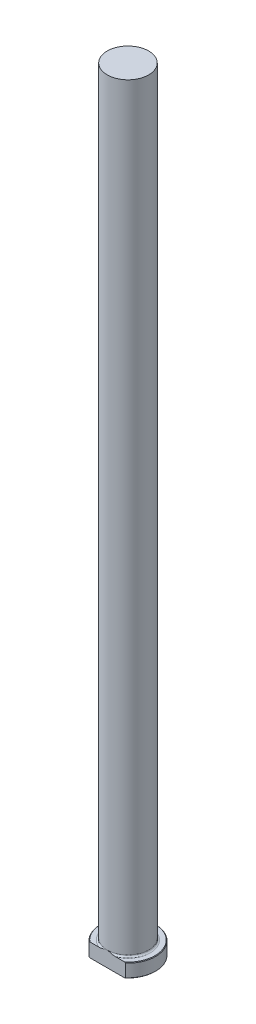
ISO-10303-21;
HEADER;
FILE_DESCRIPTION(('STEP AP214'),'2;1');
FILE_NAME('part.step','',(''),(''),'','','');
FILE_SCHEMA(('AUTOMOTIVE_DESIGN { 1 0 10303 214 1 1 1 1 }'));
ENDSEC;
DATA;
#1=APPLICATION_CONTEXT('core data for automotive mechanical design processes');
#2=APPLICATION_PROTOCOL_DEFINITION('international standard','automotive_design',2000,#1);
#3=PRODUCT_CONTEXT('',#1,'mechanical');
#4=PRODUCT('Part','Part','',(#3));
#5=PRODUCT_RELATED_PRODUCT_CATEGORY('part','',(#4));
#6=PRODUCT_DEFINITION_FORMATION('','',#4);
#7=PRODUCT_DEFINITION_CONTEXT('part definition',#1,'design');
#8=PRODUCT_DEFINITION('design','',#6,#7);
#9=PRODUCT_DEFINITION_SHAPE('','',#8);
#10=(LENGTH_UNIT() NAMED_UNIT(*) SI_UNIT(.MILLI.,.METRE.));
#11=(NAMED_UNIT(*) PLANE_ANGLE_UNIT() SI_UNIT($,.RADIAN.));
#12=(NAMED_UNIT(*) SI_UNIT($,.STERADIAN.) SOLID_ANGLE_UNIT());
#13=UNCERTAINTY_MEASURE_WITH_UNIT(LENGTH_MEASURE(1.E-05),#10,'distance_accuracy_value','');
#14=(GEOMETRIC_REPRESENTATION_CONTEXT(3) GLOBAL_UNCERTAINTY_ASSIGNED_CONTEXT((#13)) GLOBAL_UNIT_ASSIGNED_CONTEXT((#10,
#11,#12)) REPRESENTATION_CONTEXT('',''));
#15=CARTESIAN_POINT('',(0.,0.,0.));
#16=DIRECTION('',(0.,0.,1.));
#17=DIRECTION('',(1.,0.,0.));
#18=AXIS2_PLACEMENT_3D('',#15,#16,#17);
#19=CARTESIAN_POINT('',(0.,0.,0.));
#20=DIRECTION('',(0.,-1.,0.));
#21=DIRECTION('',(0.,0.,-1.));
#22=AXIS2_PLACEMENT_3D('',#19,#20,#21);
#23=PLANE('',#22);
#24=DIRECTION('',(1.,0.,0.));
#25=VECTOR('',#24,1.);
#26=CARTESIAN_POINT('',(-8.40026041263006,0.,9.52499999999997));
#27=LINE('',#26,#25);
#28=CARTESIAN_POINT('',(-8.01107302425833,0.,9.52499999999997));
#29=VERTEX_POINT('',#28);
#30=CARTESIAN_POINT('',(8.01107302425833,0.,9.52499999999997));
#31=VERTEX_POINT('',#30);
#32=EDGE_CURVE('E92',#29,#31,#27,.T.);
#33=ORIENTED_EDGE('',*,*,#32,.F.);
#34=CARTESIAN_POINT('',(0.,0.,0.));
#35=DIRECTION('',(0.,-1.,0.));
#36=DIRECTION('',(0.,0.,-1.));
#37=AXIS2_PLACEMENT_3D('',#34,#35,#36);
#38=CIRCLE('',#37,12.446);
#39=EDGE_CURVE('E105',#29,#31,#38,.T.);
#40=ORIENTED_EDGE('',*,*,#39,.T.);
#41=EDGE_LOOP('',(#33,#40));
#42=FACE_BOUND('',#41,.T.);
#43=ADVANCED_FACE('F37',(#42),#23,.T.);
#44=CARTESIAN_POINT('',(0.,259.958771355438,0.));
#45=DIRECTION('',(0.,1.,0.));
#46=DIRECTION('',(0.,0.,1.));
#47=AXIS2_PLACEMENT_3D('',#44,#45,#46);
#48=CYLINDRICAL_SURFACE('',#47,12.7);
#49=DIRECTION('',(0.,-1.,0.));
#50=VECTOR('',#49,1.);
#51=CARTESIAN_POINT('',(-8.40026041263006,355.6,9.52499999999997));
#52=LINE('',#51,#50);
#53=CARTESIAN_POINT('',(-8.40026041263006,6.0960000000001,9.52499999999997));
#54=VERTEX_POINT('',#53);
#55=CARTESIAN_POINT('',(-8.40026041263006,0.253999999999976,9.52499999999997));
#56=VERTEX_POINT('',#55);
#57=EDGE_CURVE('E95',#54,#56,#52,.T.);
#58=ORIENTED_EDGE('',*,*,#57,.F.);
#59=CARTESIAN_POINT('',(0.,6.0960000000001,0.));
#60=DIRECTION('',(0.,1.,0.));
#61=DIRECTION('',(0.,0.,1.));
#62=AXIS2_PLACEMENT_3D('',#59,#60,#61);
#63=CIRCLE('',#62,12.7);
#64=CARTESIAN_POINT('',(8.40026041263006,6.0960000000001,9.52499999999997));
#65=VERTEX_POINT('',#64);
#66=EDGE_CURVE('E109',#54,#65,#63,.F.);
#67=ORIENTED_EDGE('',*,*,#66,.T.);
#68=DIRECTION('',(0.,-1.,0.));
#69=VECTOR('',#68,1.);
#70=CARTESIAN_POINT('',(8.40026041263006,355.6,9.52499999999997));
#71=LINE('',#70,#69);
#72=CARTESIAN_POINT('',(8.40026041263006,0.253999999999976,9.52499999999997));
#73=VERTEX_POINT('',#72);
#74=EDGE_CURVE('E187',#65,#73,#71,.T.);
#75=ORIENTED_EDGE('',*,*,#74,.T.);
#76=CARTESIAN_POINT('',(0.,0.253999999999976,0.));
#77=DIRECTION('',(0.,-1.,0.));
#78=DIRECTION('',(0.,0.,-1.));
#79=AXIS2_PLACEMENT_3D('',#76,#77,#78);
#80=CIRCLE('',#79,12.7);
#81=EDGE_CURVE('E115',#73,#56,#80,.F.);
#82=ORIENTED_EDGE('',*,*,#81,.T.);
#83=EDGE_LOOP('',(#58,#67,#75,#82));
#84=FACE_BOUND('',#83,.T.);
#85=ADVANCED_FACE('F160',(#84),#48,.T.);
#86=CARTESIAN_POINT('',(-12.7,6.35,0.));
#87=DIRECTION('',(0.,1.,0.));
#88=DIRECTION('',(0.,0.,1.));
#89=AXIS2_PLACEMENT_3D('',#86,#87,#88);
#90=PLANE('',#89);
#91=DIRECTION('',(-1.,0.,0.));
#92=VECTOR('',#91,1.);
#93=CARTESIAN_POINT('',(-12.7,6.35,9.52499999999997));
#94=LINE('',#93,#92);
#95=CARTESIAN_POINT('',(8.01107302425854,6.35,9.52499999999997));
#96=VERTEX_POINT('',#95);
#97=CARTESIAN_POINT('',(3.88545286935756,6.35,9.52500000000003));
#98=VERTEX_POINT('',#97);
#99=EDGE_CURVE('E58',#96,#98,#94,.T.);
#100=ORIENTED_EDGE('',*,*,#99,.F.);
#101=CARTESIAN_POINT('',(0.,6.35,0.));
#102=DIRECTION('',(0.,1.,0.));
#103=DIRECTION('',(0.,0.,1.));
#104=AXIS2_PLACEMENT_3D('',#101,#102,#103);
#105=CIRCLE('',#104,12.4460000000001);
#106=CARTESIAN_POINT('',(-8.01107302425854,6.35,9.52499999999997));
#107=VERTEX_POINT('',#106);
#108=EDGE_CURVE('E182',#96,#107,#105,.T.);
#109=ORIENTED_EDGE('',*,*,#108,.T.);
#110=CARTESIAN_POINT('',(-3.8854528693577,6.35000000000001,9.52499999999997));
#111=VERTEX_POINT('',#110);
#112=EDGE_CURVE('E140',#111,#107,#94,.T.);
#113=ORIENTED_EDGE('',*,*,#112,.F.);
#114=CARTESIAN_POINT('',(0.,6.35,0.));
#115=DIRECTION('',(0.,1.,0.));
#116=DIRECTION('',(0.,0.,1.));
#117=AXIS2_PLACEMENT_3D('',#114,#115,#116);
#118=CIRCLE('',#117,10.287);
#119=EDGE_CURVE('E112',#111,#98,#118,.F.);
#120=ORIENTED_EDGE('',*,*,#119,.T.);
#121=EDGE_LOOP('',(#100,#109,#113,#120));
#122=FACE_BOUND('',#121,.T.);
#123=ADVANCED_FACE('F164',(#122),#90,.T.);
#124=CARTESIAN_POINT('',(0.,259.958771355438,0.));
#125=DIRECTION('',(0.,1.,0.));
#126=DIRECTION('',(0.,0.,1.));
#127=AXIS2_PLACEMENT_3D('',#124,#125,#126);
#128=CYLINDRICAL_SURFACE('',#127,9.52499999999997);
#129=CARTESIAN_POINT('',(0.,7.11200000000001,0.));
#130=DIRECTION('',(0.,1.,0.));
#131=DIRECTION('',(0.,0.,1.));
#132=AXIS2_PLACEMENT_3D('',#129,#130,#131);
#133=CIRCLE('',#132,9.52499999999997);
#134=CARTESIAN_POINT('',(0.,7.11200000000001,9.52499999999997));
#135=VERTEX_POINT('',#134);
#136=EDGE_CURVE('E108',#135,#135,#133,.T.);
#137=ORIENTED_EDGE('',*,*,#136,.T.);
#138=EDGE_LOOP('',(#137));
#139=FACE_BOUND('',#138,.T.);
#140=CARTESIAN_POINT('',(0.,355.6,0.));
#141=DIRECTION('',(0.,1.,0.));
#142=DIRECTION('',(0.,0.,1.));
#143=AXIS2_PLACEMENT_3D('',#140,#141,#142);
#144=CIRCLE('',#143,9.52499999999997);
#145=CARTESIAN_POINT('',(0.,355.6,9.52499999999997));
#146=VERTEX_POINT('',#145);
#147=EDGE_CURVE('E100',#146,#146,#144,.T.);
#148=ORIENTED_EDGE('',*,*,#147,.F.);
#149=EDGE_LOOP('',(#148));
#150=FACE_BOUND('',#149,.T.);
#151=ADVANCED_FACE('F169',(#139,#150),#128,.T.);
#152=CARTESIAN_POINT('',(-9.52499999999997,355.6,0.));
#153=DIRECTION('',(0.,1.,0.));
#154=DIRECTION('',(0.,0.,1.));
#155=AXIS2_PLACEMENT_3D('',#152,#153,#154);
#156=PLANE('',#155);
#157=ORIENTED_EDGE('',*,*,#147,.T.);
#158=EDGE_LOOP('',(#157));
#159=FACE_BOUND('',#158,.T.);
#160=ADVANCED_FACE('F127',(#159),#156,.T.);
#161=CARTESIAN_POINT('',(0.,6.35000000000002,0.));
#162=DIRECTION('',(0.,-1.,0.));
#163=DIRECTION('',(0.,0.,-1.));
#164=AXIS2_PLACEMENT_3D('',#161,#162,#163);
#165=CONICAL_SURFACE('',#164,12.4460000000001,0.785398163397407);
#166=CARTESIAN_POINT('',(8.40096041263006,6.09553698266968,9.52499999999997));
#167=CARTESIAN_POINT('',(8.19718581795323,6.23030330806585,9.52499999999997));
#168=CARTESIAN_POINT('',(7.99214985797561,6.36319262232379,9.52499999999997));
#169=CARTESIAN_POINT('',(7.5792065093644,6.62454679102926,9.52499999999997));
#170=CARTESIAN_POINT('',(7.37129839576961,6.7530104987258,9.52499999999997));
#171=CARTESIAN_POINT('',(6.95126718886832,7.00543364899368,9.52499999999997));
#172=CARTESIAN_POINT('',(6.73912770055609,7.12936591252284,9.52499999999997));
#173=CARTESIAN_POINT('',(6.31139906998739,7.37110427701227,9.52499999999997));
#174=CARTESIAN_POINT('',(6.09581015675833,7.48891078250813,9.52499999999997));
#175=CARTESIAN_POINT('',(5.65453104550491,7.72066330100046,9.52499999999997));
#176=CARTESIAN_POINT('',(5.42872918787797,7.83439842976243,9.52499999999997));
#177=CARTESIAN_POINT('',(4.97282450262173,8.05288274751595,9.52499999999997));
#178=CARTESIAN_POINT('',(4.74272123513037,8.15763101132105,9.52499999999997));
#179=CARTESIAN_POINT('',(4.04643746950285,8.45561605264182,9.52499999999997));
#180=CARTESIAN_POINT('',(3.57320500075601,8.63317555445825,9.52499999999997));
#181=CARTESIAN_POINT('',(2.80813865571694,8.86932335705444,9.52499999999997));
#182=CARTESIAN_POINT('',(2.52209293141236,8.94676233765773,9.52499999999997));
#183=CARTESIAN_POINT('',(1.94462351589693,9.0785809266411,9.52499999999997));
#184=CARTESIAN_POINT('',(1.65319965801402,9.13295981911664,9.52499999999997));
#185=CARTESIAN_POINT('',(1.07015395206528,9.21536221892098,9.52499999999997));
#186=CARTESIAN_POINT('',(0.778576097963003,9.24369294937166,9.52499999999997));
#187=CARTESIAN_POINT('',(0.194046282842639,9.27349396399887,9.52499999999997));
#188=CARTESIAN_POINT('',(-0.0989055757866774,9.27496621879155,9.52499999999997));
#189=CARTESIAN_POINT('',(-0.683872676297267,9.2509581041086,9.52499999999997));
#190=CARTESIAN_POINT('',(-0.975887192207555,9.22546035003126,9.52499999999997));
#191=CARTESIAN_POINT('',(-1.55653301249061,9.14895259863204,9.52499999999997));
#192=CARTESIAN_POINT('',(-1.84516392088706,9.09793964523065,9.52499999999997));
#193=CARTESIAN_POINT('',(-2.42072160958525,8.97227081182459,9.52499999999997));
#194=CARTESIAN_POINT('',(-2.70758843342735,8.89734394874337,9.52499999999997));
#195=CARTESIAN_POINT('',(-3.27518068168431,8.72728200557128,9.52499999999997));
#196=CARTESIAN_POINT('',(-3.55590612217,8.6321469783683,9.52499999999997));
#197=CARTESIAN_POINT('',(-4.24390979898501,8.37528793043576,9.52499999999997));
#198=CARTESIAN_POINT('',(-4.64741314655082,8.20349285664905,9.52499999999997));
#199=CARTESIAN_POINT('',(-5.4415533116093,7.83184358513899,9.52499999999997));
#200=CARTESIAN_POINT('',(-5.83217587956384,7.63195951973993,9.52499999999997));
#201=CARTESIAN_POINT('',(-6.40414722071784,7.31931527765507,9.52499999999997));
#202=CARTESIAN_POINT('',(-6.58993168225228,7.214538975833,9.52499999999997));
#203=CARTESIAN_POINT('',(-6.95899440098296,7.00063707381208,9.52499999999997));
#204=CARTESIAN_POINT('',(-7.14227255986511,6.89151130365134,9.52499999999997));
#205=CARTESIAN_POINT('',(-7.50600703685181,6.66978760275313,9.52499999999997));
#206=CARTESIAN_POINT('',(-7.68646980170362,6.55720020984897,9.52499999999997));
#207=CARTESIAN_POINT('',(-8.04526049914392,6.3287309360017,9.52499999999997));
#208=CARTESIAN_POINT('',(-8.22358875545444,6.21284956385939,9.52499999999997));
#209=CARTESIAN_POINT('',(-8.40096041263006,6.09553698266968,9.52499999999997));
#210=B_SPLINE_CURVE_WITH_KNOTS('',3,(#166,#167,#168,#169,#170,#171,#172,#173,#174,#175,#176,
#177,#178,#179,#180,#181,#182,#183,#184,#185,#186,#187,#188,#189,#190,#191,#192,#193,#194,#195,
#196,#197,#198,#199,#200,#201,#202,#203,#204,#205,#206,#207,#208,#209),.UNSPECIFIED.,.F.,.F.,(4,
2,2,2,2,2,2,2,2,2,2,2,2,2,2,2,2,2,2,2,2,4),(0.,0.732935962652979,1.46606043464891,
2.20303266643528,2.93995616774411,3.69824043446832,4.45660267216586,5.96966141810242,
6.85792094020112,7.74620803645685,8.62387862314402,9.50148481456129,10.3796570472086,
11.2579310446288,12.1465334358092,13.0351335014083,14.349271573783,15.6648177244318,
16.3046515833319,16.9445104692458,17.5825839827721,18.2205594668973),.UNSPECIFIED.);
#211=EDGE_CURVE('E63',#65,#96,#210,.T.);
#212=ORIENTED_EDGE('',*,*,#211,.F.);
#213=ORIENTED_EDGE('',*,*,#66,.F.);
#214=EDGE_CURVE('E133',#107,#54,#210,.T.);
#215=ORIENTED_EDGE('',*,*,#214,.F.);
#216=ORIENTED_EDGE('',*,*,#108,.F.);
#217=EDGE_LOOP('',(#212,#213,#215,#216));
#218=FACE_BOUND('',#217,.T.);
#219=ADVANCED_FACE('F147',(#218),#165,.T.);
#220=CARTESIAN_POINT('',(0.,0.253999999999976,0.));
#221=DIRECTION('',(0.,1.,0.));
#222=DIRECTION('',(0.,0.,1.));
#223=AXIS2_PLACEMENT_3D('',#220,#221,#222);
#224=CONICAL_SURFACE('',#223,12.7,0.785398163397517);
#225=CARTESIAN_POINT('',(-8.40096041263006,0.254463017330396,9.52499999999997));
#226=CARTESIAN_POINT('',(-8.19718581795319,0.119696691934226,9.52499999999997));
#227=CARTESIAN_POINT('',(-7.99214985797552,-0.0131926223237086,9.52499999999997));
#228=CARTESIAN_POINT('',(-7.57920650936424,-0.274546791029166,9.52499999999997));
#229=CARTESIAN_POINT('',(-7.37129839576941,-0.403010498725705,9.52499999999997));
#230=CARTESIAN_POINT('',(-6.95126718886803,-0.65543364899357,9.52499999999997));
#231=CARTESIAN_POINT('',(-6.73912770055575,-0.779365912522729,9.52499999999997));
#232=CARTESIAN_POINT('',(-6.31139906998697,-1.02110427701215,9.52499999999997));
#233=CARTESIAN_POINT('',(-6.09581015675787,-1.13891078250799,9.52499999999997));
#234=CARTESIAN_POINT('',(-5.65453104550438,-1.3706633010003,9.52499999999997));
#235=CARTESIAN_POINT('',(-5.4287291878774,-1.48439842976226,9.52499999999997));
#236=CARTESIAN_POINT('',(-4.97282450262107,-1.70288274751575,9.52499999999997));
#237=CARTESIAN_POINT('',(-4.74272123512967,-1.80763101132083,9.52499999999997));
#238=CARTESIAN_POINT('',(-4.04643746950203,-2.10561605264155,9.52499999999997));
#239=CARTESIAN_POINT('',(-3.57320500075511,-2.28317555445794,9.52499999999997));
#240=CARTESIAN_POINT('',(-2.80813865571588,-2.51932335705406,9.52499999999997));
#241=CARTESIAN_POINT('',(-2.52209293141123,-2.59676233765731,9.52499999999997));
#242=CARTESIAN_POINT('',(-1.94462351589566,-2.72858092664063,9.52499999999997));
#243=CARTESIAN_POINT('',(-1.65319965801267,-2.78295981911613,9.52499999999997));
#244=CARTESIAN_POINT('',(-1.0701539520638,-2.86536221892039,9.52499999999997));
#245=CARTESIAN_POINT('',(-0.778576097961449,-2.89369294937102,9.52499999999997));
#246=CARTESIAN_POINT('',(-0.194046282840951,-2.92349396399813,9.52499999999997));
#247=CARTESIAN_POINT('',(0.0989055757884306,-2.92496621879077,9.52499999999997));
#248=CARTESIAN_POINT('',(0.683872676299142,-2.9009581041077,9.52499999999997));
#249=CARTESIAN_POINT('',(0.975887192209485,-2.8754603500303,9.52499999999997));
#250=CARTESIAN_POINT('',(1.55653301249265,-2.79895259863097,9.52499999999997));
#251=CARTESIAN_POINT('',(1.84516392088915,-2.74793964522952,9.52499999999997));
#252=CARTESIAN_POINT('',(2.42072160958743,-2.62227081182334,9.52499999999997));
#253=CARTESIAN_POINT('',(2.70758843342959,-2.54734394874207,9.52499999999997));
#254=CARTESIAN_POINT('',(3.27518068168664,-2.37728200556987,9.52499999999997));
#255=CARTESIAN_POINT('',(3.55590612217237,-2.28214697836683,9.52499999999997));
#256=CARTESIAN_POINT('',(4.24390979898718,-2.02528793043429,9.52499999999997));
#257=CARTESIAN_POINT('',(4.64741314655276,-1.85349285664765,9.52499999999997));
#258=CARTESIAN_POINT('',(5.4415533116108,-1.48184358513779,9.52499999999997));
#259=CARTESIAN_POINT('',(5.83217587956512,-1.28195951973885,9.52499999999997));
#260=CARTESIAN_POINT('',(6.40414722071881,-0.969315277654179,9.52499999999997));
#261=CARTESIAN_POINT('',(6.58993168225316,-0.864538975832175,9.52499999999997));
#262=CARTESIAN_POINT('',(6.95899440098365,-0.6506370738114,9.52499999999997));
#263=CARTESIAN_POINT('',(7.14227255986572,-0.541511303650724,9.52499999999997));
#264=CARTESIAN_POINT('',(7.50600703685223,-0.319787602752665,9.52499999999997));
#265=CARTESIAN_POINT('',(7.68646980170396,-0.207200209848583,9.52499999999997));
#266=CARTESIAN_POINT('',(8.04526049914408,0.0212690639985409,9.52499999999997));
#267=CARTESIAN_POINT('',(8.22358875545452,0.13715043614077,9.52499999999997));
#268=CARTESIAN_POINT('',(8.40096041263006,0.254463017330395,9.52499999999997));
#269=B_SPLINE_CURVE_WITH_KNOTS('',3,(#225,#226,#227,#228,#229,#230,#231,#232,#233,#234,#235,
#236,#237,#238,#239,#240,#241,#242,#243,#244,#245,#246,#247,#248,#249,#250,#251,#252,#253,#254,
#255,#256,#257,#258,#259,#260,#261,#262,#263,#264,#265,#266,#267,#268),.UNSPECIFIED.,.F.,.F.,(4,
2,2,2,2,2,2,2,2,2,2,2,2,2,2,2,2,2,2,2,2,4),(0.,0.732935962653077,1.46606043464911,
2.20303266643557,2.9399561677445,3.6982404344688,4.45660267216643,5.96966141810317,
6.85792094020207,7.74620803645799,8.62387862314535,9.50148481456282,10.3796570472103,
11.2579310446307,12.1465334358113,13.0351335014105,14.3492715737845,15.6648177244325,
16.3046515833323,16.9445104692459,17.5825839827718,18.2205594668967),.UNSPECIFIED.);
#270=EDGE_CURVE('E89',#56,#29,#269,.T.);
#271=ORIENTED_EDGE('',*,*,#270,.F.);
#272=ORIENTED_EDGE('',*,*,#81,.F.);
#273=EDGE_CURVE('E101',#31,#73,#269,.T.);
#274=ORIENTED_EDGE('',*,*,#273,.F.);
#275=ORIENTED_EDGE('',*,*,#39,.F.);
#276=EDGE_LOOP('',(#271,#272,#274,#275));
#277=FACE_BOUND('',#276,.T.);
#278=ADVANCED_FACE('F107',(#277),#224,.T.);
#279=CARTESIAN_POINT('',(0.,7.11200000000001,0.));
#280=DIRECTION('',(0.,1.,0.));
#281=DIRECTION('',(0.,0.,1.));
#282=AXIS2_PLACEMENT_3D('',#279,#280,#281);
#283=TOROIDAL_SURFACE('',#282,10.287,0.762);
#284=ORIENTED_EDGE('',*,*,#119,.F.);
#285=CARTESIAN_POINT('',(0.,7.11200000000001,9.52499999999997));
#286=CARTESIAN_POINT('',(9.44793943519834E-11,7.11200098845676,9.52499999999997));
#287=CARTESIAN_POINT('',(-3.32154461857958E-07,7.11200197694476,9.52499999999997));
#288=CARTESIAN_POINT('',(-1.28451417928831E-06,7.11200383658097,9.52499999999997));
#289=CARTESIAN_POINT('',(-1.92426569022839E-06,7.11200469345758,9.52499999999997));
#290=CARTESIAN_POINT('',(-3.45251543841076E-06,7.11200645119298,9.52499999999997));
#291=CARTESIAN_POINT('',(-4.36508559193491E-06,7.11200733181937,9.52499999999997));
#292=CARTESIAN_POINT('',(-6.27569859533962E-06,7.11200893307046,9.52499999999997));
#293=CARTESIAN_POINT('',(-7.27105423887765E-06,7.1120096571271,9.52499999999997));
#294=CARTESIAN_POINT('',(-1.10531115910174E-05,7.11201227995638,9.52499999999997));
#295=CARTESIAN_POINT('',(-1.39454463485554E-05,7.11201403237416,9.52499999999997));
#296=CARTESIAN_POINT('',(-1.97324604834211E-05,7.11201697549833,9.52499999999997));
#297=CARTESIAN_POINT('',(-2.26119117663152E-05,7.11201819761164,9.52499999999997));
#298=CARTESIAN_POINT('',(-3.45848727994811E-05,7.11202320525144,9.52499999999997));
#299=CARTESIAN_POINT('',(-4.37413910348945E-05,7.11202685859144,9.52499999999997));
#300=CARTESIAN_POINT('',(-6.11943991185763E-05,7.11203235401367,9.52499999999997));
#301=CARTESIAN_POINT('',(-6.94339668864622E-05,7.11203437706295,9.52499999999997));
#302=CARTESIAN_POINT('',(-0.000130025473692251,7.11204892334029,9.52499999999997));
#303=CARTESIAN_POINT('',(-0.000182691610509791,7.1120597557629,9.52499999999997));
#304=CARTESIAN_POINT('',(-0.000390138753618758,7.11210716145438,9.52499999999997));
#305=CARTESIAN_POINT('',(-0.00054283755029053,7.11215258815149,9.52499999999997));
#306=CARTESIAN_POINT('',(-0.0011461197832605,7.11232885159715,9.52499999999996));
#307=CARTESIAN_POINT('',(-0.00159790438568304,7.11245379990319,9.52499999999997));
#308=CARTESIAN_POINT('',(-0.00338883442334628,7.11295304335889,9.52499999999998));
#309=CARTESIAN_POINT('',(-0.00472645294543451,7.11333464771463,9.52499999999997));
#310=CARTESIAN_POINT('',(-0.0103022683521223,7.11492091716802,9.52499999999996));
#311=CARTESIAN_POINT('',(-0.0145423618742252,7.11611650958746,9.52499999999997));
#312=CARTESIAN_POINT('',(-0.0867192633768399,7.13647430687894,9.52500000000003));
#313=CARTESIAN_POINT('',(-0.154638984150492,7.15571958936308,9.52499999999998));
#314=CARTESIAN_POINT('',(-0.287767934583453,7.19329752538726,9.52499999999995));
#315=CARTESIAN_POINT('',(-0.352975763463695,7.21163562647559,9.52499999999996));
#316=CARTESIAN_POINT('',(-0.491737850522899,7.25049193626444,9.52499999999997));
#317=CARTESIAN_POINT('',(-0.565297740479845,7.27099045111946,9.52499999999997));
#318=CARTESIAN_POINT('',(-0.713319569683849,7.3119035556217,9.52499999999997));
#319=CARTESIAN_POINT('',(-0.787782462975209,7.33231469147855,9.52499999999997));
#320=CARTESIAN_POINT('',(-0.915230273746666,7.36685900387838,9.52499999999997));
#321=CARTESIAN_POINT('',(-0.968186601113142,7.38109752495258,9.52499999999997));
#322=CARTESIAN_POINT('',(-1.07403059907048,7.40928089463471,9.52499999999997));
#323=CARTESIAN_POINT('',(-1.12691809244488,7.42322640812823,9.52499999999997));
#324=CARTESIAN_POINT('',(-1.28301939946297,7.46391694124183,9.52499999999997));
#325=CARTESIAN_POINT('',(-1.38634232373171,7.49024387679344,9.52499999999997));
#326=CARTESIAN_POINT('',(-1.68944304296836,7.56519607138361,9.52499999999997));
#327=CARTESIAN_POINT('',(-1.8897205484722,7.61183337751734,9.52499999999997));
#328=CARTESIAN_POINT('',(-2.29400914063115,7.69737651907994,9.52499999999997));
#329=CARTESIAN_POINT('',(-2.49803760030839,7.73620305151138,9.52499999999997));
#330=CARTESIAN_POINT('',(-2.81387823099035,7.78683388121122,9.52499999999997));
#331=CARTESIAN_POINT('',(-2.92501123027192,7.80285941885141,9.52499999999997));
#332=CARTESIAN_POINT('',(-3.14779936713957,7.83067921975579,9.52499999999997));
#333=CARTESIAN_POINT('',(-3.2594544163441,7.84247417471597,9.52499999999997));
#334=CARTESIAN_POINT('',(-3.48278494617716,7.86090616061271,9.52499999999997));
#335=CARTESIAN_POINT('',(-3.59445882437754,7.86756210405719,9.52499999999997));
#336=CARTESIAN_POINT('',(-3.81798645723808,7.87464978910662,9.52499999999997));
#337=CARTESIAN_POINT('',(-3.92984010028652,7.87508450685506,9.52499999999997));
#338=CARTESIAN_POINT('',(-4.10822628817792,7.86957869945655,9.52499999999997));
#339=CARTESIAN_POINT('',(-4.17483681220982,7.86613953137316,9.52499999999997));
#340=CARTESIAN_POINT('',(-4.30786151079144,7.85605502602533,9.52499999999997));
#341=CARTESIAN_POINT('',(-4.37427555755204,7.84940793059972,9.52499999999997));
#342=CARTESIAN_POINT('',(-4.50574043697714,7.83247477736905,9.52499999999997));
#343=CARTESIAN_POINT('',(-4.57079758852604,7.82223888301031,9.52499999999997));
#344=CARTESIAN_POINT('',(-4.70005884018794,7.79743182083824,9.52499999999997));
#345=CARTESIAN_POINT('',(-4.76426346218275,7.78286344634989,9.52499999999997));
#346=CARTESIAN_POINT('',(-4.88990898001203,7.74883316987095,9.52499999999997));
#347=CARTESIAN_POINT('',(-4.95137961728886,7.72948310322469,9.52499999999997));
#348=CARTESIAN_POINT('',(-5.07224009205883,7.68446325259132,9.52499999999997));
#349=CARTESIAN_POINT('',(-5.13162393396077,7.6587767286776,9.52499999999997));
#350=CARTESIAN_POINT('',(-5.23453598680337,7.60548582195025,9.52499999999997));
#351=CARTESIAN_POINT('',(-5.27881787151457,7.57935572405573,9.52499999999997));
#352=CARTESIAN_POINT('',(-5.36306427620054,7.52087999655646,9.52499999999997));
#353=CARTESIAN_POINT('',(-5.40304304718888,7.48855593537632,9.52499999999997));
#354=CARTESIAN_POINT('',(-5.46004966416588,7.43195018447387,9.52499999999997));
#355=CARTESIAN_POINT('',(-5.47955836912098,7.41018001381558,9.52499999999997));
#356=CARTESIAN_POINT('',(-5.51527668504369,7.36405786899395,9.52499999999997));
#357=CARTESIAN_POINT('',(-5.5314898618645,7.3397087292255,9.52499999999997));
#358=CARTESIAN_POINT('',(-5.55708157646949,7.2929027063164,9.52499999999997));
#359=CARTESIAN_POINT('',(-5.56715375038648,7.27082932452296,9.52499999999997));
#360=CARTESIAN_POINT('',(-5.58350208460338,7.22531141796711,9.52499999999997));
#361=CARTESIAN_POINT('',(-5.58978181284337,7.20186820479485,9.52499999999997));
#362=CARTESIAN_POINT('',(-5.597992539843,7.15405846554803,9.52499999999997));
#363=CARTESIAN_POINT('',(-5.5998952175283,7.12968695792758,9.52499999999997));
#364=CARTESIAN_POINT('',(-5.59905756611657,7.08102434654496,9.52499999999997));
#365=CARTESIAN_POINT('',(-5.59631730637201,7.05673324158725,9.52499999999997));
#366=CARTESIAN_POINT('',(-5.58698559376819,7.01144696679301,9.52499999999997));
#367=CARTESIAN_POINT('',(-5.58080461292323,6.99036439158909,9.52499999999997));
#368=CARTESIAN_POINT('',(-5.56539036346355,6.94936001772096,9.52499999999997));
#369=CARTESIAN_POINT('',(-5.556156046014,6.92943862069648,9.52499999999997));
#370=CARTESIAN_POINT('',(-5.5298398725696,6.88122286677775,9.52499999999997));
#371=CARTESIAN_POINT('',(-5.51115325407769,6.85380627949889,9.52499999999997));
#372=CARTESIAN_POINT('',(-5.46970194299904,6.80224417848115,9.52499999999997));
#373=CARTESIAN_POINT('',(-5.44692558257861,6.77810838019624,9.52499999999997));
#374=CARTESIAN_POINT('',(-5.38302390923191,6.71837292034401,9.52499999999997));
#375=CARTESIAN_POINT('',(-5.33950371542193,6.68535697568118,9.52499999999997));
#376=CARTESIAN_POINT('',(-5.24823311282,6.62605382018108,9.52499999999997));
#377=CARTESIAN_POINT('',(-5.20047793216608,6.59977433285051,9.52499999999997));
#378=CARTESIAN_POINT('',(-5.10393883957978,6.55334123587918,9.52499999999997));
#379=CARTESIAN_POINT('',(-5.05523269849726,6.53302299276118,9.52499999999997));
#380=CARTESIAN_POINT('',(-4.9562654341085,6.49653819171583,9.52499999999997));
#381=CARTESIAN_POINT('',(-4.906002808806,6.48037579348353,9.52499999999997));
#382=CARTESIAN_POINT('',(-4.80400444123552,6.45140427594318,9.52499999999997));
#383=CARTESIAN_POINT('',(-4.75225910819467,6.43862943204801,9.52499999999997));
#384=CARTESIAN_POINT('',(-4.64815423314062,6.41611875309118,9.52499999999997));
#385=CARTESIAN_POINT('',(-4.5957950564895,6.40638119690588,9.52499999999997));
#386=CARTESIAN_POINT('',(-4.46922305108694,6.3860769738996,9.52499999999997));
#387=CARTESIAN_POINT('',(-4.39480530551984,6.37679143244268,9.52499999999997));
#388=CARTESIAN_POINT('',(-4.24554902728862,6.36251533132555,9.52499999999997));
#389=CARTESIAN_POINT('',(-4.17071032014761,6.35752670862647,9.52499999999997));
#390=CARTESIAN_POINT('',(-3.94554241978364,6.34796961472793,9.52499999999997));
#391=CARTESIAN_POINT('',(-3.79497732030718,6.34886803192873,9.52499999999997));
#392=CARTESIAN_POINT('',(-3.50146085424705,6.36115019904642,9.52499999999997));
#393=CARTESIAN_POINT('',(-3.35848345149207,6.37204043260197,9.52499999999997));
#394=CARTESIAN_POINT('',(-3.0742637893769,6.40134428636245,9.52499999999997));
#395=CARTESIAN_POINT('',(-2.93301629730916,6.41970825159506,9.52499999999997));
#396=CARTESIAN_POINT('',(-2.69200870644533,6.45620557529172,9.52499999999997));
#397=CARTESIAN_POINT('',(-2.59202022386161,6.47288103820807,9.52499999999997));
#398=CARTESIAN_POINT('',(-2.39256281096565,6.50875277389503,9.52499999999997));
#399=CARTESIAN_POINT('',(-2.29309359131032,6.52794744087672,9.52499999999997));
#400=CARTESIAN_POINT('',(-2.0922148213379,6.5689415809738,9.52499999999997));
#401=CARTESIAN_POINT('',(-1.99081583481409,6.5907924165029,9.52499999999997));
#402=CARTESIAN_POINT('',(-1.78816599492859,6.63639281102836,9.52499999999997));
#403=CARTESIAN_POINT('',(-1.68691624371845,6.66014724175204,9.52499999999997));
#404=CARTESIAN_POINT('',(-1.44674283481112,6.7183773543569,9.52499999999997));
#405=CARTESIAN_POINT('',(-1.30798225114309,6.75352328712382,9.52499999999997));
#406=CARTESIAN_POINT('',(-1.03253770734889,6.82543172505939,9.52499999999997));
#407=CARTESIAN_POINT('',(-0.895847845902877,6.86217183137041,9.52499999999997));
#408=CARTESIAN_POINT('',(-0.698942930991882,6.91606570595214,9.52499999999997));
#409=CARTESIAN_POINT('',(-0.638589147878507,6.93271644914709,9.52499999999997));
#410=CARTESIAN_POINT('',(-0.517674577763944,6.96627853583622,9.52499999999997));
#411=CARTESIAN_POINT('',(-0.457114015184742,6.98319069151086,9.52499999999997));
#412=CARTESIAN_POINT('',(-0.33307447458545,7.0179593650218,9.52499999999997));
#413=CARTESIAN_POINT('',(-0.269597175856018,7.03582172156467,9.52499999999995));
#414=CARTESIAN_POINT('',(-0.143679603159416,7.07137859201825,9.52499999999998));
#415=CARTESIAN_POINT('',(-0.0812388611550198,7.08907126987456,9.52500000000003));
#416=CARTESIAN_POINT('',(-0.0145389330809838,7.10788447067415,9.52499999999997));
#417=CARTESIAN_POINT('',(-0.0102954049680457,7.1090810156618,9.52499999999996));
#418=CARTESIAN_POINT('',(-0.0047188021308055,7.11066751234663,9.52499999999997));
#419=CARTESIAN_POINT('',(-0.00338382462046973,7.11104836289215,9.52499999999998));
#420=CARTESIAN_POINT('',(-0.00159619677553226,7.11154668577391,9.52499999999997));
#421=CARTESIAN_POINT('',(-0.00114507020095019,7.11167145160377,9.52499999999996));
#422=CARTESIAN_POINT('',(-0.000542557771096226,7.11184749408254,9.52499999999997));
#423=CARTESIAN_POINT('',(-0.000389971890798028,7.11189288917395,9.52499999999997));
#424=CARTESIAN_POINT('',(-0.000182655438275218,7.11194026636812,9.52499999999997));
#425=CARTESIAN_POINT('',(-0.000130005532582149,7.11195109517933,9.52499999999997));
#426=CARTESIAN_POINT('',(-6.94304994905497E-05,7.11196563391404,9.52499999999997));
#427=CARTESIAN_POINT('',(-6.11918697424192E-05,7.11196765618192,9.52499999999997));
#428=CARTESIAN_POINT('',(-4.37407514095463E-05,7.11197314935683,9.52499999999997));
#429=CARTESIAN_POINT('',(-3.4585135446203E-05,7.11197680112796,9.52499999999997));
#430=CARTESIAN_POINT('',(-2.26130982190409E-05,7.11198180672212,9.52499999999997));
#431=CARTESIAN_POINT('',(-1.97337169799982E-05,7.11198302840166,9.52499999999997));
#432=CARTESIAN_POINT('',(-1.39467683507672E-05,7.11198597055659,9.52499999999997));
#433=CARTESIAN_POINT('',(-1.10544209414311E-05,7.11198772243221,9.52499999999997));
#434=CARTESIAN_POINT('',(-7.27225889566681E-06,7.1119903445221,9.52499999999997));
#435=CARTESIAN_POINT('',(-6.27685261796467E-06,7.11199106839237,9.52499999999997));
#436=CARTESIAN_POINT('',(-4.36610472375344E-06,7.11199266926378,9.52499999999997));
#437=CARTESIAN_POINT('',(-3.45344932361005E-06,7.11199354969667,9.52499999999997));
#438=CARTESIAN_POINT('',(-1.92499773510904E-06,7.11199530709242,9.52499999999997));
#439=CARTESIAN_POINT('',(-1.28513657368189E-06,7.11199616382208,9.52499999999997));
#440=CARTESIAN_POINT('',(-3.32502710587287E-07,7.11199802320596,9.52499999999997));
#441=CARTESIAN_POINT('',(-9.44751782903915E-11,7.11199901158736,9.52499999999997));
#442=CARTESIAN_POINT('',(0.,7.11200000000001,9.52499999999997));
#443=B_SPLINE_CURVE_WITH_KNOTS('',3,(#285,#286,#287,#288,#289,#290,#291,#292,#293,#294,#295,
#296,#297,#298,#299,#300,#301,#302,#303,#304,#305,#306,#307,#308,#309,#310,#311,#312,#313,#314,
#315,#316,#317,#318,#319,#320,#321,#322,#323,#324,#325,#326,#327,#328,#329,#330,#331,#332,#333,
#334,#335,#336,#337,#338,#339,#340,#341,#342,#343,#344,#345,#346,#347,#348,#349,#350,#351,#352,
#353,#354,#355,#356,#357,#358,#359,#360,#361,#362,#363,#364,#365,#366,#367,#368,#369,#370,#371,
#372,#373,#374,#375,#376,#377,#378,#379,#380,#381,#382,#383,#384,#385,#386,#387,#388,#389,#390,
#391,#392,#393,#394,#395,#396,#397,#398,#399,#400,#401,#402,#403,#404,#405,#406,#407,#408,#409,
#410,#411,#412,#413,#414,#415,#416,#417,#418,#419,#420,#421,#422,#423,#424,#425,#426,#427,#428,
#429,#430,#431,#432,#433,#434,#435,#436,#437,#438,#439,#440,#441,#442),.UNSPECIFIED.,.T.,.F.,(4,
2,2,2,2,2,2,2,2,2,2,2,2,2,2,2,2,2,2,2,2,2,2,2,2,2,2,2,2,2,2,2,2,2,2,2,2,2,2,2,2,2,2,2,2,2,2,2,2,
2,2,2,2,2,2,2,2,2,2,2,2,2,2,2,2,2,2,2,2,2,2,2,2,2,2,2,2,2,4),(0.,2.98024271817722E-06,
6.1830024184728E-06,9.96691583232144E-06,1.36568083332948E-05,2.37621907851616E-05,
3.31384090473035E-05,6.26536433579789E-05,8.80741001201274E-05,0.000249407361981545,
0.000726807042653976,0.00213358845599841,0.00630588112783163,0.0195229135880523,
0.231296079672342,0.434509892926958,0.663596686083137,0.895224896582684,1.0597356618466,
1.22382050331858,1.54368751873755,2.16049297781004,2.78327570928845,3.12006022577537,
3.45678965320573,3.79227386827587,4.12759758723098,4.32763355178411,4.52777927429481,
4.72523214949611,4.92255799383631,5.11564525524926,5.30924819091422,5.46313690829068,
5.61649918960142,5.7039699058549,5.79134546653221,5.86384674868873,5.93627971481,
6.00918004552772,6.08207928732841,6.14772258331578,6.21338845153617,6.31235848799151,
6.41161550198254,6.57457319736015,6.73771690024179,6.89580366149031,7.05404804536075,
7.21383723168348,7.37353570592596,7.59835636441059,7.82327831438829,8.27437601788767,
8.70432670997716,9.13146629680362,9.435543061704,9.7394269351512,10.0505865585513,
10.3625696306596,10.7919732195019,11.2165881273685,11.4044136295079,11.5930459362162,
11.7908757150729,11.9855654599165,11.9987931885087,12.0029572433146,12.0043619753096,
12.0048390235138,12.0050003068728,12.0050257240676,12.0050552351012,12.0050646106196,
12.0050747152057,12.0050784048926,12.0050821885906,12.0050853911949,12.0050883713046),.UNSPECIFIED.);
#444=EDGE_CURVE('E11',#111,#135,#443,.T.);
#445=ORIENTED_EDGE('',*,*,#444,.T.);
#446=ORIENTED_EDGE('',*,*,#136,.F.);
#447=CARTESIAN_POINT('',(0.,7.11200000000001,9.52499999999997));
#448=CARTESIAN_POINT('',(-9.44793377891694E-11,7.11199901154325,9.52499999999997));
#449=CARTESIAN_POINT('',(3.32154461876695E-07,7.11199802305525,9.52499999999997));
#450=CARTESIAN_POINT('',(1.28451417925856E-06,7.11199616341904,9.52499999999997));
#451=CARTESIAN_POINT('',(1.92426569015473E-06,7.11199530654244,9.52499999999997));
#452=CARTESIAN_POINT('',(3.45251543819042E-06,7.11199354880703,9.52499999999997));
#453=CARTESIAN_POINT('',(4.36508559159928E-06,7.11199266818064,9.52499999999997));
#454=CARTESIAN_POINT('',(6.27569859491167E-06,7.11199106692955,9.52499999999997));
#455=CARTESIAN_POINT('',(7.27105423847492E-06,7.11199034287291,9.52499999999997));
#456=CARTESIAN_POINT('',(1.1053111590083E-05,7.11198772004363,9.52499999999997));
#457=CARTESIAN_POINT('',(1.3945446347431E-05,7.11198596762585,9.52499999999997));
#458=CARTESIAN_POINT('',(1.97324604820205E-05,7.11198302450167,9.52499999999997));
#459=CARTESIAN_POINT('',(2.26119117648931E-05,7.11198180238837,9.52499999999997));
#460=CARTESIAN_POINT('',(3.45848727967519E-05,7.11197679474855,9.52499999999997));
#461=CARTESIAN_POINT('',(4.37413910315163E-05,7.11197314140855,9.52499999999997));
#462=CARTESIAN_POINT('',(6.11943991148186E-05,7.11196764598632,9.52499999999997));
#463=CARTESIAN_POINT('',(6.94339668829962E-05,7.11196562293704,9.52499999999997));
#464=CARTESIAN_POINT('',(0.000130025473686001,7.11195107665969,9.52499999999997));
#465=CARTESIAN_POINT('',(0.000182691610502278,7.11194024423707,9.52499999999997));
#466=CARTESIAN_POINT('',(0.000390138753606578,7.11189283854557,9.52499999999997));
#467=CARTESIAN_POINT('',(0.000542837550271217,7.11184741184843,9.52499999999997));
#468=CARTESIAN_POINT('',(0.00114611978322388,7.11167114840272,9.52499999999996));
#469=CARTESIAN_POINT('',(0.00159790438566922,7.11154620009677,9.52499999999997));
#470=CARTESIAN_POINT('',(0.00338883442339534,7.1110469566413,9.52499999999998));
#471=CARTESIAN_POINT('',(0.00472645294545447,7.11066535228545,9.52499999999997));
#472=CARTESIAN_POINT('',(0.0103022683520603,7.10907908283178,9.52499999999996));
#473=CARTESIAN_POINT('',(0.0145423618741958,7.10788349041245,9.52499999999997));
#474=CARTESIAN_POINT('',(0.0867192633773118,7.08752569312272,9.52500000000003));
#475=CARTESIAN_POINT('',(0.154638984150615,7.06828041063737,9.52499999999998));
#476=CARTESIAN_POINT('',(0.287767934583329,7.03070247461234,9.52499999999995));
#477=CARTESIAN_POINT('',(0.352975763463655,7.0123643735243,9.52499999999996));
#478=CARTESIAN_POINT('',(0.491737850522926,6.9735080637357,9.52499999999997));
#479=CARTESIAN_POINT('',(0.565297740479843,6.95300954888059,9.52499999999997));
#480=CARTESIAN_POINT('',(0.713319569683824,6.91209644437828,9.52499999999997));
#481=CARTESIAN_POINT('',(0.787782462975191,6.89168530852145,9.52499999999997));
#482=CARTESIAN_POINT('',(0.915230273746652,6.85714099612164,9.52499999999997));
#483=CARTESIAN_POINT('',(0.968186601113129,6.84290247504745,9.52499999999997));
#484=CARTESIAN_POINT('',(1.07403059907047,6.81471910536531,9.52499999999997));
#485=CARTESIAN_POINT('',(1.12691809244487,6.80077359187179,9.52499999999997));
#486=CARTESIAN_POINT('',(1.28301939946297,6.76008305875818,9.52499999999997));
#487=CARTESIAN_POINT('',(1.38634232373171,6.73375612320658,9.52499999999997));
#488=CARTESIAN_POINT('',(1.68944304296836,6.6588039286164,9.52499999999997));
#489=CARTESIAN_POINT('',(1.88972054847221,6.61216662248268,9.52499999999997));
#490=CARTESIAN_POINT('',(2.29400914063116,6.52662348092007,9.52499999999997));
#491=CARTESIAN_POINT('',(2.49803760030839,6.48779694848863,9.52499999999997));
#492=CARTESIAN_POINT('',(2.81387823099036,6.4371661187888,9.52499999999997));
#493=CARTESIAN_POINT('',(2.92501123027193,6.4211405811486,9.52499999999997));
#494=CARTESIAN_POINT('',(3.14779936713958,6.39332078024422,9.52499999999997));
#495=CARTESIAN_POINT('',(3.25945441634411,6.38152582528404,9.52499999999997));
#496=CARTESIAN_POINT('',(3.48278494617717,6.3630938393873,9.52499999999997));
#497=CARTESIAN_POINT('',(3.59445882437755,6.35643789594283,9.52499999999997));
#498=CARTESIAN_POINT('',(3.81798645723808,6.3493502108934,9.52499999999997));
#499=CARTESIAN_POINT('',(3.92984010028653,6.34891549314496,9.52499999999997));
#500=CARTESIAN_POINT('',(4.10822628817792,6.35442130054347,9.52499999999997));
#501=CARTESIAN_POINT('',(4.17483681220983,6.35786046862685,9.52499999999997));
#502=CARTESIAN_POINT('',(4.30786151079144,6.36794497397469,9.52499999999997));
#503=CARTESIAN_POINT('',(4.37427555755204,6.3745920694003,9.52499999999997));
#504=CARTESIAN_POINT('',(4.50574043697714,6.39152522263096,9.52499999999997));
#505=CARTESIAN_POINT('',(4.57079758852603,6.4017611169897,9.52499999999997));
#506=CARTESIAN_POINT('',(4.70005884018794,6.42656817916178,9.52499999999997));
#507=CARTESIAN_POINT('',(4.76426346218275,6.44113655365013,9.52499999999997));
#508=CARTESIAN_POINT('',(4.88990898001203,6.47516683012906,9.52499999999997));
#509=CARTESIAN_POINT('',(4.95137961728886,6.49451689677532,9.52499999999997));
#510=CARTESIAN_POINT('',(5.07224009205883,6.53953674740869,9.52499999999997));
#511=CARTESIAN_POINT('',(5.13162393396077,6.56522327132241,9.52499999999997));
#512=CARTESIAN_POINT('',(5.23453598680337,6.61851417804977,9.52499999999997));
#513=CARTESIAN_POINT('',(5.27881787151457,6.64464427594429,9.52499999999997));
#514=CARTESIAN_POINT('',(5.36306427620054,6.70312000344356,9.52499999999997));
#515=CARTESIAN_POINT('',(5.40304304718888,6.73544406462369,9.52499999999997));
#516=CARTESIAN_POINT('',(5.46004966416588,6.79204981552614,9.52499999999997));
#517=CARTESIAN_POINT('',(5.47955836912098,6.81381998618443,9.52499999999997));
#518=CARTESIAN_POINT('',(5.51527668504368,6.85994213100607,9.52499999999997));
#519=CARTESIAN_POINT('',(5.5314898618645,6.88429127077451,9.52499999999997));
#520=CARTESIAN_POINT('',(5.55708157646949,6.93109729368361,9.52499999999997));
#521=CARTESIAN_POINT('',(5.56715375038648,6.95317067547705,9.52499999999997));
#522=CARTESIAN_POINT('',(5.58350208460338,6.99868858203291,9.52499999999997));
#523=CARTESIAN_POINT('',(5.58978181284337,7.02213179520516,9.52499999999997));
#524=CARTESIAN_POINT('',(5.597992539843,7.06994153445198,9.52499999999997));
#525=CARTESIAN_POINT('',(5.5998952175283,7.09431304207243,9.52499999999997));
#526=CARTESIAN_POINT('',(5.59905756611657,7.14297565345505,9.52499999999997));
#527=CARTESIAN_POINT('',(5.59631730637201,7.16726675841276,9.52499999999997));
#528=CARTESIAN_POINT('',(5.58698559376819,7.212553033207,9.52499999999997));
#529=CARTESIAN_POINT('',(5.58080461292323,7.23363560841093,9.52499999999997));
#530=CARTESIAN_POINT('',(5.56539036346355,7.27463998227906,9.52499999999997));
#531=CARTESIAN_POINT('',(5.556156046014,7.29456137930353,9.52499999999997));
#532=CARTESIAN_POINT('',(5.5298398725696,7.34277713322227,9.52499999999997));
#533=CARTESIAN_POINT('',(5.51115325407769,7.37019372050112,9.52499999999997));
#534=CARTESIAN_POINT('',(5.46970194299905,7.42175582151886,9.52499999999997));
#535=CARTESIAN_POINT('',(5.44692558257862,7.44589161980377,9.52499999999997));
#536=CARTESIAN_POINT('',(5.38302390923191,7.505627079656,9.52499999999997));
#537=CARTESIAN_POINT('',(5.33950371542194,7.53864302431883,9.52499999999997));
#538=CARTESIAN_POINT('',(5.24823311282,7.59794617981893,9.52499999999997));
#539=CARTESIAN_POINT('',(5.20047793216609,7.62422566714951,9.52499999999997));
#540=CARTESIAN_POINT('',(5.10393883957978,7.67065876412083,9.52499999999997));
#541=CARTESIAN_POINT('',(5.05523269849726,7.69097700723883,9.52499999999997));
#542=CARTESIAN_POINT('',(4.95626543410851,7.72746180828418,9.52499999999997));
#543=CARTESIAN_POINT('',(4.90600280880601,7.74362420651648,9.52499999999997));
#544=CARTESIAN_POINT('',(4.80400444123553,7.77259572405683,9.52499999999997));
#545=CARTESIAN_POINT('',(4.75225910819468,7.785370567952,9.52499999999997));
#546=CARTESIAN_POINT('',(4.64815423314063,7.80788124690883,9.52499999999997));
#547=CARTESIAN_POINT('',(4.59579505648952,7.81761880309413,9.52499999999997));
#548=CARTESIAN_POINT('',(4.46922305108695,7.83792302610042,9.52499999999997));
#549=CARTESIAN_POINT('',(4.39480530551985,7.84720856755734,9.52499999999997));
#550=CARTESIAN_POINT('',(4.24554902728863,7.86148466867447,9.52499999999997));
#551=CARTESIAN_POINT('',(4.17071032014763,7.86647329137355,9.52499999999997));
#552=CARTESIAN_POINT('',(3.94554241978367,7.87603038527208,9.52499999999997));
#553=CARTESIAN_POINT('',(3.79497732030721,7.87513196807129,9.52499999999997));
#554=CARTESIAN_POINT('',(3.50146085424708,7.8628498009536,9.52499999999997));
#555=CARTESIAN_POINT('',(3.3584834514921,7.85195956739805,9.52499999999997));
#556=CARTESIAN_POINT('',(3.07426378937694,7.82265571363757,9.52499999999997));
#557=CARTESIAN_POINT('',(2.9330162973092,7.80429174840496,9.52499999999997));
#558=CARTESIAN_POINT('',(2.69200870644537,7.7677944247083,9.52499999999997));
#559=CARTESIAN_POINT('',(2.59202022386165,7.75111896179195,9.52499999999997));
#560=CARTESIAN_POINT('',(2.39256281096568,7.71524722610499,9.52499999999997));
#561=CARTESIAN_POINT('',(2.29309359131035,7.6960525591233,9.52499999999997));
#562=CARTESIAN_POINT('',(2.09221482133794,7.65505841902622,9.52499999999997));
#563=CARTESIAN_POINT('',(1.99081583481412,7.63320758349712,9.52499999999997));
#564=CARTESIAN_POINT('',(1.78816599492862,7.58760718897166,9.52499999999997));
#565=CARTESIAN_POINT('',(1.68691624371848,7.56385275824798,9.52499999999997));
#566=CARTESIAN_POINT('',(1.44674283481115,7.50562264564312,9.52499999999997));
#567=CARTESIAN_POINT('',(1.30798225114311,7.47047671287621,9.52499999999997));
#568=CARTESIAN_POINT('',(1.03253770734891,7.39856827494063,9.52499999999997));
#569=CARTESIAN_POINT('',(0.895847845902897,7.36182816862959,9.52499999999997));
#570=CARTESIAN_POINT('',(0.698942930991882,7.30793429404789,9.52499999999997));
#571=CARTESIAN_POINT('',(0.638589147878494,7.29128355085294,9.52499999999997));
#572=CARTESIAN_POINT('',(0.517674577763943,7.25772146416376,9.52499999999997));
#573=CARTESIAN_POINT('',(0.457114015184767,7.24080930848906,9.52499999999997));
#574=CARTESIAN_POINT('',(0.333074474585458,7.20604063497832,9.52499999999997));
#575=CARTESIAN_POINT('',(0.269597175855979,7.18817827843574,9.52499999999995));
#576=CARTESIAN_POINT('',(0.143679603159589,7.15262140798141,9.52499999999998));
#577=CARTESIAN_POINT('',(0.0812388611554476,7.1349287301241,9.52500000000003));
#578=CARTESIAN_POINT('',(0.0145389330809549,7.11611552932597,9.52499999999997));
#579=CARTESIAN_POINT('',(0.0102954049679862,7.11491898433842,9.52499999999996));
#580=CARTESIAN_POINT('',(0.0047188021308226,7.11333248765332,9.52499999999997));
#581=CARTESIAN_POINT('',(0.00338382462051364,7.1129516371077,9.52499999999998));
#582=CARTESIAN_POINT('',(0.00159619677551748,7.11245331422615,9.52499999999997));
#583=CARTESIAN_POINT('',(0.00114507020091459,7.11232854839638,9.52499999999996));
#584=CARTESIAN_POINT('',(0.000542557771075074,7.11215250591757,9.52499999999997));
#585=CARTESIAN_POINT('',(0.000389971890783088,7.11210711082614,9.52499999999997));
#586=CARTESIAN_POINT('',(0.000182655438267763,7.11205973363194,9.52499999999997));
#587=CARTESIAN_POINT('',(0.000130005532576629,7.11204890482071,9.52499999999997));
#588=CARTESIAN_POINT('',(6.94304994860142E-05,7.112034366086,9.52499999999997));
#589=CARTESIAN_POINT('',(6.11918697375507E-05,7.11203234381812,9.52499999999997));
#590=CARTESIAN_POINT('',(4.374075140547E-05,7.1120268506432,9.52499999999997));
#591=CARTESIAN_POINT('',(3.4585135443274E-05,7.11202319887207,9.52499999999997));
#592=CARTESIAN_POINT('',(2.26130982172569E-05,7.11201819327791,9.52499999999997));
#593=CARTESIAN_POINT('',(1.97337169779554E-05,7.11201697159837,9.52499999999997));
#594=CARTESIAN_POINT('',(1.39467683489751E-05,7.11201402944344,9.52499999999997));
#595=CARTESIAN_POINT('',(1.10544209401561E-05,7.11201227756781,9.52499999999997));
#596=CARTESIAN_POINT('',(7.27225889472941E-06,7.11200965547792,9.52499999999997));
#597=CARTESIAN_POINT('',(6.27685261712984E-06,7.11200893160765,9.52499999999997));
#598=CARTESIAN_POINT('',(4.36610472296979E-06,7.11200733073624,9.52499999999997));
#599=CARTESIAN_POINT('',(3.4534493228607E-06,7.11200645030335,9.52499999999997));
#600=CARTESIAN_POINT('',(1.92499773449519E-06,7.1120046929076,9.52499999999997));
#601=CARTESIAN_POINT('',(1.28513657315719E-06,7.11200383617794,9.52499999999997));
#602=CARTESIAN_POINT('',(3.32502710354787E-07,7.11200197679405,9.52499999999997));
#603=CARTESIAN_POINT('',(9.44751217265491E-11,7.11200098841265,9.52499999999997));
#604=CARTESIAN_POINT('',(0.,7.11200000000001,9.52499999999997));
#605=B_SPLINE_CURVE_WITH_KNOTS('',3,(#447,#448,#449,#450,#451,#452,#453,#454,#455,#456,#457,
#458,#459,#460,#461,#462,#463,#464,#465,#466,#467,#468,#469,#470,#471,#472,#473,#474,#475,#476,
#477,#478,#479,#480,#481,#482,#483,#484,#485,#486,#487,#488,#489,#490,#491,#492,#493,#494,#495,
#496,#497,#498,#499,#500,#501,#502,#503,#504,#505,#506,#507,#508,#509,#510,#511,#512,#513,#514,
#515,#516,#517,#518,#519,#520,#521,#522,#523,#524,#525,#526,#527,#528,#529,#530,#531,#532,#533,
#534,#535,#536,#537,#538,#539,#540,#541,#542,#543,#544,#545,#546,#547,#548,#549,#550,#551,#552,
#553,#554,#555,#556,#557,#558,#559,#560,#561,#562,#563,#564,#565,#566,#567,#568,#569,#570,#571,
#572,#573,#574,#575,#576,#577,#578,#579,#580,#581,#582,#583,#584,#585,#586,#587,#588,#589,#590,
#591,#592,#593,#594,#595,#596,#597,#598,#599,#600,#601,#602,#603,#604),.UNSPECIFIED.,.T.,.F.,(4,
2,2,2,2,2,2,2,2,2,2,2,2,2,2,2,2,2,2,2,2,2,2,2,2,2,2,2,2,2,2,2,2,2,2,2,2,2,2,2,2,2,2,2,2,2,2,2,2,
2,2,2,2,2,2,2,2,2,2,2,2,2,2,2,2,2,2,2,2,2,2,2,2,2,2,2,2,2,4),(0.,2.98024271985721E-06,
6.18300242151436E-06,9.96691583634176E-06,1.36568083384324E-05,2.37621907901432E-05,
3.31384090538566E-05,6.26536433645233E-05,8.80741001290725E-05,0.000249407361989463,
0.000726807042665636,0.00213358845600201,0.00630588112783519,0.0195229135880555,
0.231296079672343,0.434509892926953,0.663596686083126,0.89522489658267,1.05973566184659,
1.22382050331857,1.54368751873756,2.16049297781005,2.78327570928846,3.12006022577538,
3.45678965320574,3.79227386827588,4.12759758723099,4.32763355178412,4.52777927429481,
4.72523214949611,4.92255799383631,5.11564525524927,5.30924819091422,5.46313690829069,
5.61649918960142,5.7039699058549,5.79134546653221,5.86384674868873,5.93627971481,
6.00918004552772,6.08207928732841,6.14772258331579,6.21338845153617,6.31235848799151,
6.41161550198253,6.57457319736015,6.73771690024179,6.8958036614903,7.05404804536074,
7.21383723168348,7.37353570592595,7.59835636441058,7.82327831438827,8.27437601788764,
8.70432670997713,9.13146629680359,9.43554306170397,9.73942693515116,10.0505865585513,
10.3625696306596,10.7919732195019,11.2165881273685,11.4044136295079,11.5930459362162,
11.7908757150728,11.9855654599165,11.9987931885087,12.0029572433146,12.0043619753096,
12.0048390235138,12.0050003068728,12.0050257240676,12.0050552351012,12.0050646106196,
12.0050747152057,12.0050784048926,12.0050821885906,12.0050853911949,12.0050883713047),.UNSPECIFIED.);
#606=EDGE_CURVE('E51',#135,#98,#605,.T.);
#607=ORIENTED_EDGE('',*,*,#606,.T.);
#608=EDGE_LOOP('',(#284,#445,#446,#607));
#609=FACE_BOUND('',#608,.T.);
#610=ADVANCED_FACE('F39',(#609),#283,.F.);
#611=CARTESIAN_POINT('',(-8.40026041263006,355.6,9.52499999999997));
#612=DIRECTION('',(0.,0.,-1.));
#613=DIRECTION('',(-1.,0.,0.));
#614=AXIS2_PLACEMENT_3D('',#611,#612,#613);
#615=PLANE('',#614);
#616=ORIENTED_EDGE('',*,*,#270,.T.);
#617=ORIENTED_EDGE('',*,*,#32,.T.);
#618=ORIENTED_EDGE('',*,*,#273,.T.);
#619=ORIENTED_EDGE('',*,*,#74,.F.);
#620=ORIENTED_EDGE('',*,*,#211,.T.);
#621=ORIENTED_EDGE('',*,*,#99,.T.);
#622=ORIENTED_EDGE('',*,*,#606,.F.);
#623=ORIENTED_EDGE('',*,*,#444,.F.);
#624=ORIENTED_EDGE('',*,*,#112,.T.);
#625=ORIENTED_EDGE('',*,*,#214,.T.);
#626=ORIENTED_EDGE('',*,*,#57,.T.);
#627=EDGE_LOOP('',(#616,#617,#618,#619,#620,#621,#622,#623,#624,#625,#626));
#628=FACE_BOUND('',#627,.T.);
#629=ADVANCED_FACE('F91',(#628),#615,.F.);
#630=CLOSED_SHELL('',(#43,#85,#123,#151,#160,#219,#278,#610,#629));
#631=MANIFOLD_SOLID_BREP('B2',#630);
#632=ADVANCED_BREP_SHAPE_REPRESENTATION('',(#18,#631),#14);
#633=SHAPE_DEFINITION_REPRESENTATION(#9,#632);
ENDSEC;
END-ISO-10303-21;
